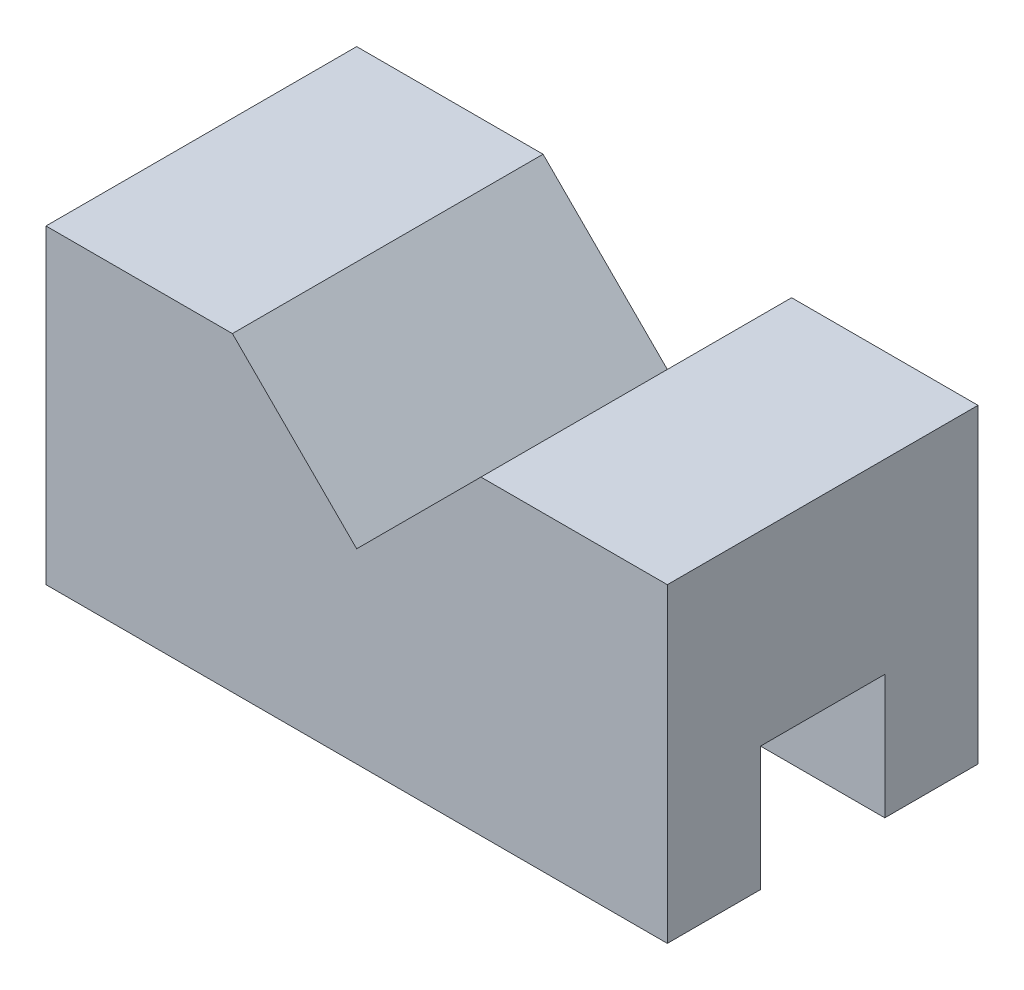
ISO-10303-21;
HEADER;
FILE_DESCRIPTION(('STEP AP214'),'2;1');
FILE_NAME('part.step','',(''),(''),'','','');
FILE_SCHEMA(('AUTOMOTIVE_DESIGN { 1 0 10303 214 1 1 1 1 }'));
ENDSEC;
DATA;
#1=APPLICATION_CONTEXT('core data for automotive mechanical design processes');
#2=APPLICATION_PROTOCOL_DEFINITION('international standard','automotive_design',2000,#1);
#3=PRODUCT_CONTEXT('',#1,'mechanical');
#4=PRODUCT('Part','Part','',(#3));
#5=PRODUCT_RELATED_PRODUCT_CATEGORY('part','',(#4));
#6=PRODUCT_DEFINITION_FORMATION('','',#4);
#7=PRODUCT_DEFINITION_CONTEXT('part definition',#1,'design');
#8=PRODUCT_DEFINITION('design','',#6,#7);
#9=PRODUCT_DEFINITION_SHAPE('','',#8);
#10=(LENGTH_UNIT() NAMED_UNIT(*) SI_UNIT(.MILLI.,.METRE.));
#11=(NAMED_UNIT(*) PLANE_ANGLE_UNIT() SI_UNIT($,.RADIAN.));
#12=(NAMED_UNIT(*) SI_UNIT($,.STERADIAN.) SOLID_ANGLE_UNIT());
#13=UNCERTAINTY_MEASURE_WITH_UNIT(LENGTH_MEASURE(1.E-05),#10,'distance_accuracy_value','');
#14=(GEOMETRIC_REPRESENTATION_CONTEXT(3) GLOBAL_UNCERTAINTY_ASSIGNED_CONTEXT((#13)) GLOBAL_UNIT_ASSIGNED_CONTEXT((#10,
#11,#12)) REPRESENTATION_CONTEXT('',''));
#15=CARTESIAN_POINT('',(0.,0.,0.));
#16=DIRECTION('',(0.,0.,1.));
#17=DIRECTION('',(1.,0.,0.));
#18=AXIS2_PLACEMENT_3D('',#15,#16,#17);
#19=CARTESIAN_POINT('',(-50.,0.,-25.));
#20=DIRECTION('',(0.,-1.,0.));
#21=DIRECTION('',(0.,0.,-1.));
#22=AXIS2_PLACEMENT_3D('',#19,#20,#21);
#23=PLANE('',#22);
#24=DIRECTION('',(1.,0.,0.));
#25=VECTOR('',#24,1.);
#26=CARTESIAN_POINT('',(-50.,0.,10.));
#27=LINE('',#26,#25);
#28=CARTESIAN_POINT('',(-50.,0.,10.));
#29=VERTEX_POINT('',#28);
#30=CARTESIAN_POINT('',(50.,0.,10.));
#31=VERTEX_POINT('',#30);
#32=EDGE_CURVE('E204',#29,#31,#27,.T.);
#33=ORIENTED_EDGE('',*,*,#32,.T.);
#34=DIRECTION('',(0.,0.,1.));
#35=VECTOR('',#34,1.);
#36=CARTESIAN_POINT('',(50.,0.,-25.));
#37=LINE('',#36,#35);
#38=CARTESIAN_POINT('',(50.,0.,25.));
#39=VERTEX_POINT('',#38);
#40=EDGE_CURVE('E162',#31,#39,#37,.T.);
#41=ORIENTED_EDGE('',*,*,#40,.T.);
#42=DIRECTION('',(1.,0.,0.));
#43=VECTOR('',#42,1.);
#44=CARTESIAN_POINT('',(-50.,0.,25.));
#45=LINE('',#44,#43);
#46=CARTESIAN_POINT('',(-50.,0.,25.));
#47=VERTEX_POINT('',#46);
#48=EDGE_CURVE('E140',#47,#39,#45,.T.);
#49=ORIENTED_EDGE('',*,*,#48,.F.);
#50=DIRECTION('',(0.,0.,1.));
#51=VECTOR('',#50,1.);
#52=CARTESIAN_POINT('',(-50.,0.,-25.));
#53=LINE('',#52,#51);
#54=EDGE_CURVE('E136',#29,#47,#53,.T.);
#55=ORIENTED_EDGE('',*,*,#54,.F.);
#56=EDGE_LOOP('',(#33,#41,#49,#55));
#57=FACE_BOUND('',#56,.T.);
#58=ADVANCED_FACE('F31',(#57),#23,.T.);
#59=CARTESIAN_POINT('',(-50.,0.,-25.));
#60=DIRECTION('',(-1.,0.,0.));
#61=DIRECTION('',(0.,0.,1.));
#62=AXIS2_PLACEMENT_3D('',#59,#60,#61);
#63=PLANE('',#62);
#64=DIRECTION('',(0.,-1.,0.));
#65=VECTOR('',#64,1.);
#66=CARTESIAN_POINT('',(-50.,0.,10.));
#67=LINE('',#66,#65);
#68=CARTESIAN_POINT('',(-50.,20.,9.99999999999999));
#69=VERTEX_POINT('',#68);
#70=EDGE_CURVE('E174',#69,#29,#67,.T.);
#71=ORIENTED_EDGE('',*,*,#70,.T.);
#72=ORIENTED_EDGE('',*,*,#54,.T.);
#73=DIRECTION('',(0.,-1.,0.));
#74=VECTOR('',#73,1.);
#75=CARTESIAN_POINT('',(-50.,0.,25.));
#76=LINE('',#75,#74);
#77=CARTESIAN_POINT('',(-50.,50.,25.));
#78=VERTEX_POINT('',#77);
#79=EDGE_CURVE('E137',#78,#47,#76,.T.);
#80=ORIENTED_EDGE('',*,*,#79,.F.);
#81=DIRECTION('',(0.,0.,1.));
#82=VECTOR('',#81,1.);
#83=CARTESIAN_POINT('',(-50.,50.,-25.));
#84=LINE('',#83,#82);
#85=CARTESIAN_POINT('',(-50.,50.,-25.));
#86=VERTEX_POINT('',#85);
#87=EDGE_CURVE('E11',#86,#78,#84,.T.);
#88=ORIENTED_EDGE('',*,*,#87,.F.);
#89=DIRECTION('',(0.,-1.,0.));
#90=VECTOR('',#89,1.);
#91=CARTESIAN_POINT('',(-50.,0.,-25.));
#92=LINE('',#91,#90);
#93=CARTESIAN_POINT('',(-50.,0.,-25.));
#94=VERTEX_POINT('',#93);
#95=EDGE_CURVE('E155',#86,#94,#92,.T.);
#96=ORIENTED_EDGE('',*,*,#95,.T.);
#97=CARTESIAN_POINT('',(-50.,0.,-10.));
#98=VERTEX_POINT('',#97);
#99=EDGE_CURVE('E35',#94,#98,#53,.T.);
#100=ORIENTED_EDGE('',*,*,#99,.T.);
#101=DIRECTION('',(0.,1.,0.));
#102=VECTOR('',#101,1.);
#103=CARTESIAN_POINT('',(-50.,0.,-10.));
#104=LINE('',#103,#102);
#105=CARTESIAN_POINT('',(-50.,20.,-10.));
#106=VERTEX_POINT('',#105);
#107=EDGE_CURVE('E48',#98,#106,#104,.T.);
#108=ORIENTED_EDGE('',*,*,#107,.T.);
#109=DIRECTION('',(0.,0.,1.));
#110=VECTOR('',#109,1.);
#111=CARTESIAN_POINT('',(-50.,20.,9.99999999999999));
#112=LINE('',#111,#110);
#113=EDGE_CURVE('E208',#106,#69,#112,.T.);
#114=ORIENTED_EDGE('',*,*,#113,.T.);
#115=EDGE_LOOP('',(#71,#72,#80,#88,#96,#100,#108,#114));
#116=FACE_BOUND('',#115,.T.);
#117=ADVANCED_FACE('F33',(#116),#63,.T.);
#118=CARTESIAN_POINT('',(-50.,50.,-25.));
#119=DIRECTION('',(0.,1.,0.));
#120=DIRECTION('',(0.,0.,1.));
#121=AXIS2_PLACEMENT_3D('',#118,#119,#120);
#122=PLANE('',#121);
#123=DIRECTION('',(-1.,0.,0.));
#124=VECTOR('',#123,1.);
#125=CARTESIAN_POINT('',(-50.,50.,25.));
#126=LINE('',#125,#124);
#127=CARTESIAN_POINT('',(-20.,50.,25.));
#128=VERTEX_POINT('',#127);
#129=EDGE_CURVE('E153',#128,#78,#126,.T.);
#130=ORIENTED_EDGE('',*,*,#129,.F.);
#131=DIRECTION('',(0.,0.,1.));
#132=VECTOR('',#131,1.);
#133=CARTESIAN_POINT('',(-20.,50.,-25.));
#134=LINE('',#133,#132);
#135=CARTESIAN_POINT('',(-20.,50.,-25.));
#136=VERTEX_POINT('',#135);
#137=EDGE_CURVE('E40',#136,#128,#134,.T.);
#138=ORIENTED_EDGE('',*,*,#137,.F.);
#139=DIRECTION('',(-1.,0.,0.));
#140=VECTOR('',#139,1.);
#141=CARTESIAN_POINT('',(-50.,50.,-25.));
#142=LINE('',#141,#140);
#143=EDGE_CURVE('E126',#136,#86,#142,.T.);
#144=ORIENTED_EDGE('',*,*,#143,.T.);
#145=ORIENTED_EDGE('',*,*,#87,.T.);
#146=EDGE_LOOP('',(#130,#138,#144,#145));
#147=FACE_BOUND('',#146,.T.);
#148=ADVANCED_FACE('F177',(#147),#122,.T.);
#149=CARTESIAN_POINT('',(-20.,50.,-25.));
#150=DIRECTION('',(0.707106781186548,0.707106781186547,0.));
#151=DIRECTION('',(-0.707106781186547,0.707106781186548,0.));
#152=AXIS2_PLACEMENT_3D('',#149,#150,#151);
#153=PLANE('',#152);
#154=DIRECTION('',(-0.707106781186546,0.707106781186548,0.));
#155=VECTOR('',#154,1.);
#156=CARTESIAN_POINT('',(-20.,50.,25.));
#157=LINE('',#156,#155);
#158=CARTESIAN_POINT('',(0.,29.9999999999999,25.));
#159=VERTEX_POINT('',#158);
#160=EDGE_CURVE('E113',#159,#128,#157,.T.);
#161=ORIENTED_EDGE('',*,*,#160,.F.);
#162=DIRECTION('',(0.,0.,1.));
#163=VECTOR('',#162,1.);
#164=CARTESIAN_POINT('',(0.,29.9999999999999,-25.));
#165=LINE('',#164,#163);
#166=CARTESIAN_POINT('',(0.,29.9999999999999,-25.));
#167=VERTEX_POINT('',#166);
#168=EDGE_CURVE('E107',#167,#159,#165,.T.);
#169=ORIENTED_EDGE('',*,*,#168,.F.);
#170=DIRECTION('',(-0.707106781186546,0.707106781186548,0.));
#171=VECTOR('',#170,1.);
#172=CARTESIAN_POINT('',(-20.,50.,-25.));
#173=LINE('',#172,#171);
#174=EDGE_CURVE('E110',#167,#136,#173,.T.);
#175=ORIENTED_EDGE('',*,*,#174,.T.);
#176=ORIENTED_EDGE('',*,*,#137,.T.);
#177=EDGE_LOOP('',(#161,#169,#175,#176));
#178=FACE_BOUND('',#177,.T.);
#179=ADVANCED_FACE('F109',(#178),#153,.T.);
#180=CARTESIAN_POINT('',(0.,29.9999999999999,-25.));
#181=DIRECTION('',(-0.707106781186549,0.707106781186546,0.));
#182=DIRECTION('',(-0.707106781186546,-0.707106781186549,0.));
#183=AXIS2_PLACEMENT_3D('',#180,#181,#182);
#184=PLANE('',#183);
#185=DIRECTION('',(-0.707106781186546,-0.707106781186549,0.));
#186=VECTOR('',#185,1.);
#187=CARTESIAN_POINT('',(0.,29.9999999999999,25.));
#188=LINE('',#187,#186);
#189=CARTESIAN_POINT('',(20.,50.,25.));
#190=VERTEX_POINT('',#189);
#191=EDGE_CURVE('E150',#190,#159,#188,.T.);
#192=ORIENTED_EDGE('',*,*,#191,.F.);
#193=DIRECTION('',(0.,0.,1.));
#194=VECTOR('',#193,1.);
#195=CARTESIAN_POINT('',(20.,50.,-25.));
#196=LINE('',#195,#194);
#197=CARTESIAN_POINT('',(20.,50.,-25.));
#198=VERTEX_POINT('',#197);
#199=EDGE_CURVE('E118',#198,#190,#196,.T.);
#200=ORIENTED_EDGE('',*,*,#199,.F.);
#201=DIRECTION('',(-0.707106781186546,-0.707106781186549,0.));
#202=VECTOR('',#201,1.);
#203=CARTESIAN_POINT('',(0.,29.9999999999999,-25.));
#204=LINE('',#203,#202);
#205=EDGE_CURVE('E124',#198,#167,#204,.T.);
#206=ORIENTED_EDGE('',*,*,#205,.T.);
#207=ORIENTED_EDGE('',*,*,#168,.T.);
#208=EDGE_LOOP('',(#192,#200,#206,#207));
#209=FACE_BOUND('',#208,.T.);
#210=ADVANCED_FACE('F128',(#209),#184,.T.);
#211=CARTESIAN_POINT('',(20.,50.,-25.));
#212=DIRECTION('',(0.,1.,0.));
#213=DIRECTION('',(0.,0.,1.));
#214=AXIS2_PLACEMENT_3D('',#211,#212,#213);
#215=PLANE('',#214);
#216=DIRECTION('',(-1.,0.,0.));
#217=VECTOR('',#216,1.);
#218=CARTESIAN_POINT('',(20.,50.,25.));
#219=LINE('',#218,#217);
#220=CARTESIAN_POINT('',(50.,50.,25.));
#221=VERTEX_POINT('',#220);
#222=EDGE_CURVE('E147',#221,#190,#219,.T.);
#223=ORIENTED_EDGE('',*,*,#222,.F.);
#224=DIRECTION('',(0.,0.,1.));
#225=VECTOR('',#224,1.);
#226=CARTESIAN_POINT('',(50.,50.,-25.));
#227=LINE('',#226,#225);
#228=CARTESIAN_POINT('',(50.,50.,-25.));
#229=VERTEX_POINT('',#228);
#230=EDGE_CURVE('E159',#229,#221,#227,.T.);
#231=ORIENTED_EDGE('',*,*,#230,.F.);
#232=DIRECTION('',(-1.,0.,0.));
#233=VECTOR('',#232,1.);
#234=CARTESIAN_POINT('',(20.,50.,-25.));
#235=LINE('',#234,#233);
#236=EDGE_CURVE('E129',#229,#198,#235,.T.);
#237=ORIENTED_EDGE('',*,*,#236,.T.);
#238=ORIENTED_EDGE('',*,*,#199,.T.);
#239=EDGE_LOOP('',(#223,#231,#237,#238));
#240=FACE_BOUND('',#239,.T.);
#241=ADVANCED_FACE('F198',(#240),#215,.T.);
#242=CARTESIAN_POINT('',(50.,0.,-25.));
#243=DIRECTION('',(1.,0.,0.));
#244=DIRECTION('',(0.,0.,-1.));
#245=AXIS2_PLACEMENT_3D('',#242,#243,#244);
#246=PLANE('',#245);
#247=DIRECTION('',(0.,-1.,0.));
#248=VECTOR('',#247,1.);
#249=CARTESIAN_POINT('',(50.,0.,10.));
#250=LINE('',#249,#248);
#251=CARTESIAN_POINT('',(50.,20.,9.99999999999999));
#252=VERTEX_POINT('',#251);
#253=EDGE_CURVE('E222',#252,#31,#250,.T.);
#254=ORIENTED_EDGE('',*,*,#253,.F.);
#255=DIRECTION('',(0.,0.,1.));
#256=VECTOR('',#255,1.);
#257=CARTESIAN_POINT('',(50.,20.,9.99999999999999));
#258=LINE('',#257,#256);
#259=CARTESIAN_POINT('',(50.,20.,-10.));
#260=VERTEX_POINT('',#259);
#261=EDGE_CURVE('E238',#260,#252,#258,.T.);
#262=ORIENTED_EDGE('',*,*,#261,.F.);
#263=DIRECTION('',(0.,1.,0.));
#264=VECTOR('',#263,1.);
#265=CARTESIAN_POINT('',(50.,0.,-10.));
#266=LINE('',#265,#264);
#267=CARTESIAN_POINT('',(50.,0.,-10.));
#268=VERTEX_POINT('',#267);
#269=EDGE_CURVE('E245',#268,#260,#266,.T.);
#270=ORIENTED_EDGE('',*,*,#269,.F.);
#271=CARTESIAN_POINT('',(50.,0.,-25.));
#272=VERTEX_POINT('',#271);
#273=EDGE_CURVE('E160',#272,#268,#37,.T.);
#274=ORIENTED_EDGE('',*,*,#273,.F.);
#275=DIRECTION('',(0.,1.,0.));
#276=VECTOR('',#275,1.);
#277=CARTESIAN_POINT('',(50.,0.,-25.));
#278=LINE('',#277,#276);
#279=EDGE_CURVE('E131',#272,#229,#278,.T.);
#280=ORIENTED_EDGE('',*,*,#279,.T.);
#281=ORIENTED_EDGE('',*,*,#230,.T.);
#282=DIRECTION('',(0.,1.,0.));
#283=VECTOR('',#282,1.);
#284=CARTESIAN_POINT('',(50.,0.,25.));
#285=LINE('',#284,#283);
#286=EDGE_CURVE('E144',#39,#221,#285,.T.);
#287=ORIENTED_EDGE('',*,*,#286,.F.);
#288=ORIENTED_EDGE('',*,*,#40,.F.);
#289=EDGE_LOOP('',(#254,#262,#270,#274,#280,#281,#287,#288));
#290=FACE_BOUND('',#289,.T.);
#291=ADVANCED_FACE('F192',(#290),#246,.T.);
#292=DIRECTION('',(1.,0.,0.));
#293=VECTOR('',#292,1.);
#294=CARTESIAN_POINT('',(-50.,0.,-10.));
#295=LINE('',#294,#293);
#296=EDGE_CURVE('E200',#98,#268,#295,.T.);
#297=ORIENTED_EDGE('',*,*,#296,.F.);
#298=ORIENTED_EDGE('',*,*,#99,.F.);
#299=DIRECTION('',(1.,0.,0.));
#300=VECTOR('',#299,1.);
#301=CARTESIAN_POINT('',(-50.,0.,-25.));
#302=LINE('',#301,#300);
#303=EDGE_CURVE('E213',#94,#272,#302,.T.);
#304=ORIENTED_EDGE('',*,*,#303,.T.);
#305=ORIENTED_EDGE('',*,*,#273,.T.);
#306=EDGE_LOOP('',(#297,#298,#304,#305));
#307=FACE_BOUND('',#306,.T.);
#308=ADVANCED_FACE('F187',(#307),#23,.T.);
#309=CARTESIAN_POINT('',(-50.,50.,-25.));
#310=DIRECTION('',(0.,0.,-1.));
#311=DIRECTION('',(-1.,0.,0.));
#312=AXIS2_PLACEMENT_3D('',#309,#310,#311);
#313=PLANE('',#312);
#314=ORIENTED_EDGE('',*,*,#95,.F.);
#315=ORIENTED_EDGE('',*,*,#143,.F.);
#316=ORIENTED_EDGE('',*,*,#174,.F.);
#317=ORIENTED_EDGE('',*,*,#205,.F.);
#318=ORIENTED_EDGE('',*,*,#236,.F.);
#319=ORIENTED_EDGE('',*,*,#279,.F.);
#320=ORIENTED_EDGE('',*,*,#303,.F.);
#321=EDGE_LOOP('',(#314,#315,#316,#317,#318,#319,#320));
#322=FACE_BOUND('',#321,.T.);
#323=ADVANCED_FACE('F122',(#322),#313,.T.);
#324=CARTESIAN_POINT('',(-50.,50.,25.));
#325=DIRECTION('',(0.,0.,-1.));
#326=DIRECTION('',(-1.,0.,0.));
#327=AXIS2_PLACEMENT_3D('',#324,#325,#326);
#328=PLANE('',#327);
#329=ORIENTED_EDGE('',*,*,#79,.T.);
#330=ORIENTED_EDGE('',*,*,#48,.T.);
#331=ORIENTED_EDGE('',*,*,#286,.T.);
#332=ORIENTED_EDGE('',*,*,#222,.T.);
#333=ORIENTED_EDGE('',*,*,#191,.T.);
#334=ORIENTED_EDGE('',*,*,#160,.T.);
#335=ORIENTED_EDGE('',*,*,#129,.T.);
#336=EDGE_LOOP('',(#329,#330,#331,#332,#333,#334,#335));
#337=FACE_BOUND('',#336,.T.);
#338=ADVANCED_FACE('F176',(#337),#328,.F.);
#339=CARTESIAN_POINT('',(-50.,0.,10.));
#340=DIRECTION('',(0.,0.,1.));
#341=DIRECTION('',(0.,-1.,0.));
#342=AXIS2_PLACEMENT_3D('',#339,#340,#341);
#343=PLANE('',#342);
#344=ORIENTED_EDGE('',*,*,#253,.T.);
#345=ORIENTED_EDGE('',*,*,#32,.F.);
#346=ORIENTED_EDGE('',*,*,#70,.F.);
#347=DIRECTION('',(1.,0.,0.));
#348=VECTOR('',#347,1.);
#349=CARTESIAN_POINT('',(-50.,20.,9.99999999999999));
#350=LINE('',#349,#348);
#351=EDGE_CURVE('E141',#69,#252,#350,.T.);
#352=ORIENTED_EDGE('',*,*,#351,.T.);
#353=EDGE_LOOP('',(#344,#345,#346,#352));
#354=FACE_BOUND('',#353,.T.);
#355=ADVANCED_FACE('F239',(#354),#343,.F.);
#356=CARTESIAN_POINT('',(-50.,20.,9.99999999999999));
#357=DIRECTION('',(0.,1.,0.));
#358=DIRECTION('',(0.,0.,1.));
#359=AXIS2_PLACEMENT_3D('',#356,#357,#358);
#360=PLANE('',#359);
#361=ORIENTED_EDGE('',*,*,#261,.T.);
#362=ORIENTED_EDGE('',*,*,#351,.F.);
#363=ORIENTED_EDGE('',*,*,#113,.F.);
#364=DIRECTION('',(1.,0.,0.));
#365=VECTOR('',#364,1.);
#366=CARTESIAN_POINT('',(-50.,20.,-10.));
#367=LINE('',#366,#365);
#368=EDGE_CURVE('E203',#106,#260,#367,.T.);
#369=ORIENTED_EDGE('',*,*,#368,.T.);
#370=EDGE_LOOP('',(#361,#362,#363,#369));
#371=FACE_BOUND('',#370,.T.);
#372=ADVANCED_FACE('F237',(#371),#360,.F.);
#373=CARTESIAN_POINT('',(-50.,0.,-10.));
#374=DIRECTION('',(0.,0.,-1.));
#375=DIRECTION('',(-1.,0.,0.));
#376=AXIS2_PLACEMENT_3D('',#373,#374,#375);
#377=PLANE('',#376);
#378=ORIENTED_EDGE('',*,*,#269,.T.);
#379=ORIENTED_EDGE('',*,*,#368,.F.);
#380=ORIENTED_EDGE('',*,*,#107,.F.);
#381=ORIENTED_EDGE('',*,*,#296,.T.);
#382=EDGE_LOOP('',(#378,#379,#380,#381));
#383=FACE_BOUND('',#382,.T.);
#384=ADVANCED_FACE('F247',(#383),#377,.F.);
#385=CLOSED_SHELL('',(#58,#117,#148,#179,#210,#241,#291,#308,#323,#338,#355,#372,#384));
#386=MANIFOLD_SOLID_BREP('B2',#385);
#387=ADVANCED_BREP_SHAPE_REPRESENTATION('',(#18,#386),#14);
#388=SHAPE_DEFINITION_REPRESENTATION(#9,#387);
ENDSEC;
END-ISO-10303-21;
